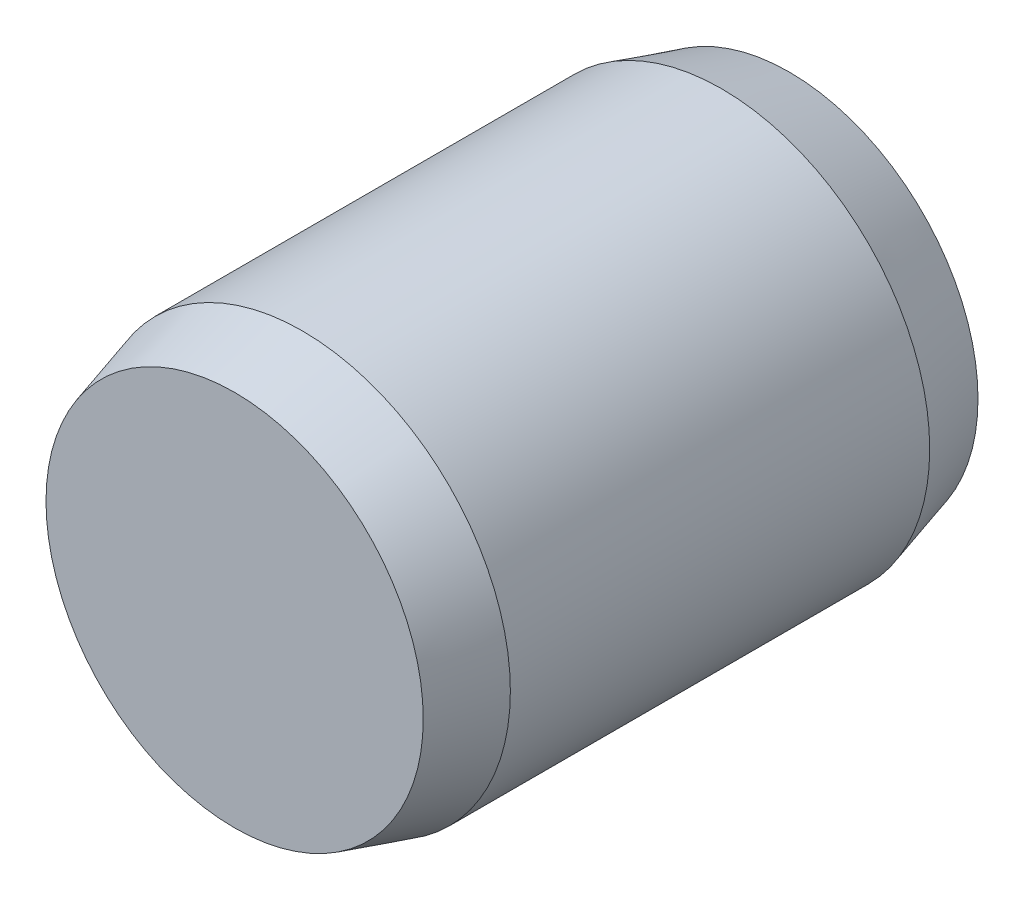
ISO-10303-21;
HEADER;
FILE_DESCRIPTION(('STEP AP214'),'2;1');
FILE_NAME('part.step','',(''),(''),'','','');
FILE_SCHEMA(('AUTOMOTIVE_DESIGN { 1 0 10303 214 1 1 1 1 }'));
ENDSEC;
DATA;
#1=APPLICATION_CONTEXT('core data for automotive mechanical design processes');
#2=APPLICATION_PROTOCOL_DEFINITION('international standard','automotive_design',2000,#1);
#3=PRODUCT_CONTEXT('',#1,'mechanical');
#4=PRODUCT('Part','Part','',(#3));
#5=PRODUCT_RELATED_PRODUCT_CATEGORY('part','',(#4));
#6=PRODUCT_DEFINITION_FORMATION('','',#4);
#7=PRODUCT_DEFINITION_CONTEXT('part definition',#1,'design');
#8=PRODUCT_DEFINITION('design','',#6,#7);
#9=PRODUCT_DEFINITION_SHAPE('','',#8);
#10=(LENGTH_UNIT() NAMED_UNIT(*) SI_UNIT(.MILLI.,.METRE.));
#11=(NAMED_UNIT(*) PLANE_ANGLE_UNIT() SI_UNIT($,.RADIAN.));
#12=(NAMED_UNIT(*) SI_UNIT($,.STERADIAN.) SOLID_ANGLE_UNIT());
#13=UNCERTAINTY_MEASURE_WITH_UNIT(LENGTH_MEASURE(1.E-05),#10,'distance_accuracy_value','');
#14=(GEOMETRIC_REPRESENTATION_CONTEXT(3) GLOBAL_UNCERTAINTY_ASSIGNED_CONTEXT((#13)) GLOBAL_UNIT_ASSIGNED_CONTEXT((#10,
#11,#12)) REPRESENTATION_CONTEXT('',''));
#15=CARTESIAN_POINT('',(0.,0.,0.));
#16=DIRECTION('',(0.,0.,1.));
#17=DIRECTION('',(1.,0.,0.));
#18=AXIS2_PLACEMENT_3D('',#15,#16,#17);
#19=CARTESIAN_POINT('',(0.,0.,3.175));
#20=DIRECTION('',(0.,0.,-1.));
#21=DIRECTION('',(-1.,0.,0.));
#22=AXIS2_PLACEMENT_3D('',#19,#20,#21);
#23=PLANE('',#22);
#24=CARTESIAN_POINT('',(0.,0.,3.175));
#25=DIRECTION('',(0.,0.,1.));
#26=DIRECTION('',(1.,0.,0.));
#27=AXIS2_PLACEMENT_3D('',#24,#25,#26);
#28=CIRCLE('',#27,2.159);
#29=CARTESIAN_POINT('',(2.159,0.,3.175));
#30=VERTEX_POINT('',#29);
#31=EDGE_CURVE('E10',#30,#30,#28,.T.);
#32=ORIENTED_EDGE('',*,*,#31,.T.);
#33=EDGE_LOOP('',(#32));
#34=FACE_BOUND('',#33,.T.);
#35=ADVANCED_FACE('F30',(#34),#23,.F.);
#36=CARTESIAN_POINT('',(0.,0.,2.39992213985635));
#37=DIRECTION('',(0.,0.,-1.));
#38=DIRECTION('',(-1.,0.,0.));
#39=AXIS2_PLACEMENT_3D('',#36,#37,#38);
#40=CONICAL_SURFACE('',#39,2.38125,0.27925268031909);
#41=ORIENTED_EDGE('',*,*,#31,.F.);
#42=EDGE_LOOP('',(#41));
#43=FACE_BOUND('',#42,.T.);
#44=CARTESIAN_POINT('',(0.,0.,2.39992213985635));
#45=DIRECTION('',(0.,0.,1.));
#46=DIRECTION('',(1.,0.,0.));
#47=AXIS2_PLACEMENT_3D('',#44,#45,#46);
#48=CIRCLE('',#47,2.38125);
#49=CARTESIAN_POINT('',(2.38125,0.,2.39992213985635));
#50=VERTEX_POINT('',#49);
#51=EDGE_CURVE('E36',#50,#50,#48,.T.);
#52=ORIENTED_EDGE('',*,*,#51,.T.);
#53=EDGE_LOOP('',(#52));
#54=FACE_BOUND('',#53,.T.);
#55=ADVANCED_FACE('F62',(#43,#54),#40,.T.);
#56=CARTESIAN_POINT('',(0.,0.,3.175));
#57=DIRECTION('',(0.,0.,1.));
#58=DIRECTION('',(1.,0.,0.));
#59=AXIS2_PLACEMENT_3D('',#56,#57,#58);
#60=CYLINDRICAL_SURFACE('',#59,2.38125);
#61=ORIENTED_EDGE('',*,*,#51,.F.);
#62=EDGE_LOOP('',(#61));
#63=FACE_BOUND('',#62,.T.);
#64=CARTESIAN_POINT('',(0.,0.,-2.39992213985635));
#65=DIRECTION('',(0.,0.,1.));
#66=DIRECTION('',(1.,0.,0.));
#67=AXIS2_PLACEMENT_3D('',#64,#65,#66);
#68=CIRCLE('',#67,2.38125);
#69=CARTESIAN_POINT('',(2.38125,0.,-2.39992213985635));
#70=VERTEX_POINT('',#69);
#71=EDGE_CURVE('E40',#70,#70,#68,.T.);
#72=ORIENTED_EDGE('',*,*,#71,.T.);
#73=EDGE_LOOP('',(#72));
#74=FACE_BOUND('',#73,.T.);
#75=ADVANCED_FACE('F58',(#63,#74),#60,.T.);
#76=CARTESIAN_POINT('',(0.,0.,-3.175));
#77=DIRECTION('',(0.,0.,1.));
#78=DIRECTION('',(1.,0.,0.));
#79=AXIS2_PLACEMENT_3D('',#76,#77,#78);
#80=CONICAL_SURFACE('',#79,2.159,0.27925268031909);
#81=ORIENTED_EDGE('',*,*,#71,.F.);
#82=EDGE_LOOP('',(#81));
#83=FACE_BOUND('',#82,.T.);
#84=CARTESIAN_POINT('',(0.,0.,-3.175));
#85=DIRECTION('',(0.,0.,1.));
#86=DIRECTION('',(1.,0.,0.));
#87=AXIS2_PLACEMENT_3D('',#84,#85,#86);
#88=CIRCLE('',#87,2.159);
#89=CARTESIAN_POINT('',(2.159,0.,-3.175));
#90=VERTEX_POINT('',#89);
#91=EDGE_CURVE('E44',#90,#90,#88,.T.);
#92=ORIENTED_EDGE('',*,*,#91,.T.);
#93=EDGE_LOOP('',(#92));
#94=FACE_BOUND('',#93,.T.);
#95=ADVANCED_FACE('F50',(#83,#94),#80,.T.);
#96=CARTESIAN_POINT('',(0.,2.159,-3.175));
#97=DIRECTION('',(0.,0.,1.));
#98=DIRECTION('',(1.,0.,0.));
#99=AXIS2_PLACEMENT_3D('',#96,#97,#98);
#100=PLANE('',#99);
#101=ORIENTED_EDGE('',*,*,#91,.F.);
#102=EDGE_LOOP('',(#101));
#103=FACE_BOUND('',#102,.T.);
#104=ADVANCED_FACE('F52',(#103),#100,.F.);
#105=CLOSED_SHELL('',(#35,#55,#75,#95,#104));
#106=MANIFOLD_SOLID_BREP('B2',#105);
#107=ADVANCED_BREP_SHAPE_REPRESENTATION('',(#18,#106),#14);
#108=SHAPE_DEFINITION_REPRESENTATION(#9,#107);
ENDSEC;
END-ISO-10303-21;
